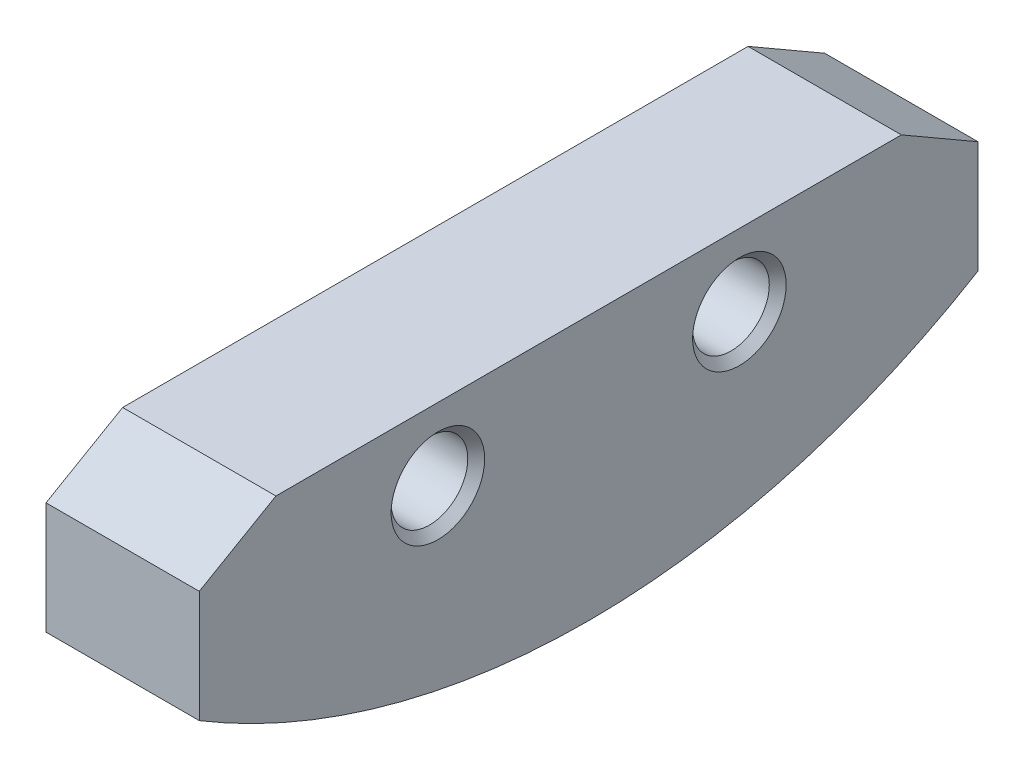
ISO-10303-21;
HEADER;
FILE_DESCRIPTION(('STEP AP214'),'2;1');
FILE_NAME('part.step','',(''),(''),'','','');
FILE_SCHEMA(('AUTOMOTIVE_DESIGN { 1 0 10303 214 1 1 1 1 }'));
ENDSEC;
DATA;
#1=APPLICATION_CONTEXT('core data for automotive mechanical design processes');
#2=APPLICATION_PROTOCOL_DEFINITION('international standard','automotive_design',2000,#1);
#3=PRODUCT_CONTEXT('',#1,'mechanical');
#4=PRODUCT('Part','Part','',(#3));
#5=PRODUCT_RELATED_PRODUCT_CATEGORY('part','',(#4));
#6=PRODUCT_DEFINITION_FORMATION('','',#4);
#7=PRODUCT_DEFINITION_CONTEXT('part definition',#1,'design');
#8=PRODUCT_DEFINITION('design','',#6,#7);
#9=PRODUCT_DEFINITION_SHAPE('','',#8);
#10=(LENGTH_UNIT() NAMED_UNIT(*) SI_UNIT(.MILLI.,.METRE.));
#11=(NAMED_UNIT(*) PLANE_ANGLE_UNIT() SI_UNIT($,.RADIAN.));
#12=(NAMED_UNIT(*) SI_UNIT($,.STERADIAN.) SOLID_ANGLE_UNIT());
#13=UNCERTAINTY_MEASURE_WITH_UNIT(LENGTH_MEASURE(1.E-05),#10,'distance_accuracy_value','');
#14=(GEOMETRIC_REPRESENTATION_CONTEXT(3) GLOBAL_UNCERTAINTY_ASSIGNED_CONTEXT((#13)) GLOBAL_UNIT_ASSIGNED_CONTEXT((#10,
#11,#12)) REPRESENTATION_CONTEXT('',''));
#15=CARTESIAN_POINT('',(0.,0.,0.));
#16=DIRECTION('',(0.,0.,1.));
#17=DIRECTION('',(1.,0.,0.));
#18=AXIS2_PLACEMENT_3D('',#15,#16,#17);
#19=CARTESIAN_POINT('',(2.5,0.,0.));
#20=DIRECTION('',(1.,0.,0.));
#21=DIRECTION('',(0.,0.,-1.));
#22=AXIS2_PLACEMENT_3D('',#19,#20,#21);
#23=PLANE('',#22);
#24=CARTESIAN_POINT('',(2.5,-18.3526072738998,-4.9175));
#25=DIRECTION('',(1.,0.,0.));
#26=DIRECTION('',(0.,0.,-1.));
#27=AXIS2_PLACEMENT_3D('',#24,#25,#26);
#28=CIRCLE('',#27,1.525);
#29=CARTESIAN_POINT('',(2.5,-18.3526072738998,-6.4425));
#30=VERTEX_POINT('',#29);
#31=EDGE_CURVE('E153',#30,#30,#28,.T.);
#32=ORIENTED_EDGE('',*,*,#31,.F.);
#33=EDGE_LOOP('',(#32));
#34=FACE_BOUND('',#33,.T.);
#35=CARTESIAN_POINT('',(2.5,-18.3526072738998,4.9175));
#36=DIRECTION('',(1.,0.,0.));
#37=DIRECTION('',(0.,0.,-1.));
#38=AXIS2_PLACEMENT_3D('',#35,#36,#37);
#39=CIRCLE('',#38,1.525);
#40=CARTESIAN_POINT('',(2.5,-18.3526072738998,3.3925));
#41=VERTEX_POINT('',#40);
#42=EDGE_CURVE('E144',#41,#41,#39,.T.);
#43=ORIENTED_EDGE('',*,*,#42,.F.);
#44=EDGE_LOOP('',(#43));
#45=FACE_BOUND('',#44,.T.);
#46=DIRECTION('',(0.,1.,0.));
#47=VECTOR('',#46,1.);
#48=CARTESIAN_POINT('',(2.5,-12.8916829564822,-12.7));
#49=LINE('',#48,#47);
#50=CARTESIAN_POINT('',(2.5,-21.0974080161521,-12.7));
#51=VERTEX_POINT('',#50);
#52=CARTESIAN_POINT('',(2.5,-17.4433756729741,-12.7));
#53=VERTEX_POINT('',#52);
#54=EDGE_CURVE('E90',#51,#53,#49,.T.);
#55=ORIENTED_EDGE('',*,*,#54,.T.);
#56=DIRECTION('',(0.,0.499999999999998,0.86602540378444));
#57=VECTOR('',#56,1.);
#58=CARTESIAN_POINT('',(2.5,-7.58327044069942,4.37820323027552));
#59=LINE('',#58,#57);
#60=CARTESIAN_POINT('',(2.5,-16.,-10.2));
#61=VERTEX_POINT('',#60);
#62=EDGE_CURVE('E44',#53,#61,#59,.T.);
#63=ORIENTED_EDGE('',*,*,#62,.T.);
#64=DIRECTION('',(0.,0.,-1.));
#65=VECTOR('',#64,1.);
#66=CARTESIAN_POINT('',(2.5,-16.,18.7187239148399));
#67=LINE('',#66,#65);
#68=CARTESIAN_POINT('',(2.5,-16.,10.2));
#69=VERTEX_POINT('',#68);
#70=EDGE_CURVE('E125',#69,#61,#67,.T.);
#71=ORIENTED_EDGE('',*,*,#70,.F.);
#72=DIRECTION('',(0.,0.499999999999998,-0.86602540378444));
#73=VECTOR('',#72,1.);
#74=CARTESIAN_POINT('',(2.5,-7.58327044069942,-4.37820323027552));
#75=LINE('',#74,#73);
#76=CARTESIAN_POINT('',(2.5,-17.4433756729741,12.7));
#77=VERTEX_POINT('',#76);
#78=EDGE_CURVE('E51',#69,#77,#75,.F.);
#79=ORIENTED_EDGE('',*,*,#78,.T.);
#80=DIRECTION('',(0.,1.,0.));
#81=VECTOR('',#80,1.);
#82=CARTESIAN_POINT('',(2.5,-12.8916829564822,12.7));
#83=LINE('',#82,#81);
#84=CARTESIAN_POINT('',(2.5,-21.0974080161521,12.7));
#85=VERTEX_POINT('',#84);
#86=EDGE_CURVE('E107',#85,#77,#83,.T.);
#87=ORIENTED_EDGE('',*,*,#86,.F.);
#88=CARTESIAN_POINT('',(2.5,0.,0.));
#89=DIRECTION('',(1.,0.,0.));
#90=DIRECTION('',(0.,0.,-1.));
#91=AXIS2_PLACEMENT_3D('',#88,#89,#90);
#92=CIRCLE('',#91,24.625);
#93=EDGE_CURVE('E103',#85,#51,#92,.T.);
#94=ORIENTED_EDGE('',*,*,#93,.T.);
#95=EDGE_LOOP('',(#55,#63,#71,#79,#87,#94));
#96=FACE_BOUND('',#95,.T.);
#97=ADVANCED_FACE('F36',(#34,#45,#96),#23,.T.);
#98=CARTESIAN_POINT('',(-2.5,0.,0.));
#99=DIRECTION('',(1.,0.,0.));
#100=DIRECTION('',(0.,0.,-1.));
#101=AXIS2_PLACEMENT_3D('',#98,#99,#100);
#102=PLANE('',#101);
#103=DIRECTION('',(0.,0.,1.));
#104=VECTOR('',#103,1.);
#105=CARTESIAN_POINT('',(-2.5,-16.,18.7187239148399));
#106=LINE('',#105,#104);
#107=CARTESIAN_POINT('',(-2.5,-16.,-10.2));
#108=VERTEX_POINT('',#107);
#109=CARTESIAN_POINT('',(-2.5,-16.,10.2));
#110=VERTEX_POINT('',#109);
#111=EDGE_CURVE('E112',#108,#110,#106,.T.);
#112=ORIENTED_EDGE('',*,*,#111,.F.);
#113=DIRECTION('',(0.,-0.499999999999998,-0.86602540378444));
#114=VECTOR('',#113,1.);
#115=CARTESIAN_POINT('',(-2.5,-16.,-10.2));
#116=LINE('',#115,#114);
#117=CARTESIAN_POINT('',(-2.5,-17.4433756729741,-12.7));
#118=VERTEX_POINT('',#117);
#119=EDGE_CURVE('E121',#108,#118,#116,.T.);
#120=ORIENTED_EDGE('',*,*,#119,.T.);
#121=DIRECTION('',(0.,-1.,0.));
#122=VECTOR('',#121,1.);
#123=CARTESIAN_POINT('',(-2.5,-12.8916829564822,-12.7));
#124=LINE('',#123,#122);
#125=CARTESIAN_POINT('',(-2.5,-21.0974080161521,-12.7));
#126=VERTEX_POINT('',#125);
#127=EDGE_CURVE('E97',#118,#126,#124,.T.);
#128=ORIENTED_EDGE('',*,*,#127,.T.);
#129=CARTESIAN_POINT('',(-2.5,0.,0.));
#130=DIRECTION('',(1.,0.,0.));
#131=DIRECTION('',(0.,0.,-1.));
#132=AXIS2_PLACEMENT_3D('',#129,#130,#131);
#133=CIRCLE('',#132,24.625);
#134=CARTESIAN_POINT('',(-2.5,-21.0974080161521,12.7));
#135=VERTEX_POINT('',#134);
#136=EDGE_CURVE('E105',#135,#126,#133,.T.);
#137=ORIENTED_EDGE('',*,*,#136,.F.);
#138=DIRECTION('',(0.,-1.,0.));
#139=VECTOR('',#138,1.);
#140=CARTESIAN_POINT('',(-2.5,-12.8916829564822,12.7));
#141=LINE('',#140,#139);
#142=CARTESIAN_POINT('',(-2.5,-17.4433756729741,12.7));
#143=VERTEX_POINT('',#142);
#144=EDGE_CURVE('E142',#143,#135,#141,.T.);
#145=ORIENTED_EDGE('',*,*,#144,.F.);
#146=DIRECTION('',(0.,-0.499999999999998,0.86602540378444));
#147=VECTOR('',#146,1.);
#148=CARTESIAN_POINT('',(-2.5,-17.4433756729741,12.7));
#149=LINE('',#148,#147);
#150=EDGE_CURVE('E119',#143,#110,#149,.F.);
#151=ORIENTED_EDGE('',*,*,#150,.T.);
#152=EDGE_LOOP('',(#112,#120,#128,#137,#145,#151));
#153=FACE_BOUND('',#152,.T.);
#154=ADVANCED_FACE('F136',(#153),#102,.F.);
#155=CARTESIAN_POINT('',(2.5,0.,0.));
#156=DIRECTION('',(-1.,0.,0.));
#157=DIRECTION('',(0.,0.,1.));
#158=AXIS2_PLACEMENT_3D('',#155,#156,#157);
#159=CYLINDRICAL_SURFACE('',#158,24.625);
#160=DIRECTION('',(-1.,0.,0.));
#161=VECTOR('',#160,1.);
#162=CARTESIAN_POINT('',(2.5,-21.0974080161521,-12.7));
#163=LINE('',#162,#161);
#164=EDGE_CURVE('E93',#126,#51,#163,.F.);
#165=ORIENTED_EDGE('',*,*,#164,.T.);
#166=ORIENTED_EDGE('',*,*,#93,.F.);
#167=DIRECTION('',(-1.,0.,0.));
#168=VECTOR('',#167,1.);
#169=CARTESIAN_POINT('',(2.5,-21.0974080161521,12.7));
#170=LINE('',#169,#168);
#171=EDGE_CURVE('E137',#135,#85,#170,.F.);
#172=ORIENTED_EDGE('',*,*,#171,.F.);
#173=ORIENTED_EDGE('',*,*,#136,.T.);
#174=EDGE_LOOP('',(#165,#166,#172,#173));
#175=FACE_BOUND('',#174,.T.);
#176=ADVANCED_FACE('F101',(#175),#159,.T.);
#177=CARTESIAN_POINT('',(-2.501,-16.,18.7187239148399));
#178=DIRECTION('',(0.,-1.,0.));
#179=DIRECTION('',(0.,0.,-1.));
#180=AXIS2_PLACEMENT_3D('',#177,#178,#179);
#181=PLANE('',#180);
#182=ORIENTED_EDGE('',*,*,#70,.T.);
#183=DIRECTION('',(-1.,0.,0.));
#184=VECTOR('',#183,1.);
#185=CARTESIAN_POINT('',(-2.5,-16.,-10.2));
#186=LINE('',#185,#184);
#187=EDGE_CURVE('E110',#61,#108,#186,.T.);
#188=ORIENTED_EDGE('',*,*,#187,.T.);
#189=ORIENTED_EDGE('',*,*,#111,.T.);
#190=DIRECTION('',(1.,0.,0.));
#191=VECTOR('',#190,1.);
#192=CARTESIAN_POINT('',(-2.501,-16.,10.2));
#193=LINE('',#192,#191);
#194=EDGE_CURVE('E108',#110,#69,#193,.T.);
#195=ORIENTED_EDGE('',*,*,#194,.T.);
#196=EDGE_LOOP('',(#182,#188,#189,#195));
#197=FACE_BOUND('',#196,.T.);
#198=ADVANCED_FACE('F129',(#197),#181,.F.);
#199=CARTESIAN_POINT('',(-1.,-18.3526072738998,-4.9175));
#200=DIRECTION('',(-1.,0.,0.));
#201=DIRECTION('',(0.,0.,1.));
#202=AXIS2_PLACEMENT_3D('',#199,#200,#201);
#203=PLANE('',#202);
#204=CARTESIAN_POINT('',(-1.,-18.3526072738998,-4.9175));
#205=DIRECTION('',(1.,0.,0.));
#206=DIRECTION('',(0.,0.,-1.));
#207=AXIS2_PLACEMENT_3D('',#204,#205,#206);
#208=CIRCLE('',#207,1.25);
#209=CARTESIAN_POINT('',(-1.,-18.3526072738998,-6.1675));
#210=VERTEX_POINT('',#209);
#211=EDGE_CURVE('E133',#210,#210,#208,.T.);
#212=ORIENTED_EDGE('',*,*,#211,.T.);
#213=EDGE_LOOP('',(#212));
#214=FACE_BOUND('',#213,.T.);
#215=ADVANCED_FACE('F162',(#214),#203,.F.);
#216=CARTESIAN_POINT('',(2.5,-18.3526072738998,-4.9175));
#217=DIRECTION('',(1.,0.,0.));
#218=DIRECTION('',(0.,0.,-1.));
#219=AXIS2_PLACEMENT_3D('',#216,#217,#218);
#220=CYLINDRICAL_SURFACE('',#219,1.25);
#221=ORIENTED_EDGE('',*,*,#211,.F.);
#222=EDGE_LOOP('',(#221));
#223=FACE_BOUND('',#222,.T.);
#224=CARTESIAN_POINT('',(2.225,-18.3526072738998,-4.9175));
#225=DIRECTION('',(1.,0.,0.));
#226=DIRECTION('',(0.,0.,-1.));
#227=AXIS2_PLACEMENT_3D('',#224,#225,#226);
#228=CIRCLE('',#227,1.25);
#229=CARTESIAN_POINT('',(2.225,-18.3526072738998,-6.1675));
#230=VERTEX_POINT('',#229);
#231=EDGE_CURVE('E156',#230,#230,#228,.T.);
#232=ORIENTED_EDGE('',*,*,#231,.T.);
#233=EDGE_LOOP('',(#232));
#234=FACE_BOUND('',#233,.T.);
#235=ADVANCED_FACE('F164',(#223,#234),#220,.F.);
#236=CARTESIAN_POINT('',(2.5,-18.3526072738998,-4.9175));
#237=DIRECTION('',(1.,0.,0.));
#238=DIRECTION('',(0.,0.,-1.));
#239=AXIS2_PLACEMENT_3D('',#236,#237,#238);
#240=CONICAL_SURFACE('',#239,1.525,0.785398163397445);
#241=ORIENTED_EDGE('',*,*,#231,.F.);
#242=EDGE_LOOP('',(#241));
#243=FACE_BOUND('',#242,.T.);
#244=ORIENTED_EDGE('',*,*,#31,.T.);
#245=EDGE_LOOP('',(#244));
#246=FACE_BOUND('',#245,.T.);
#247=ADVANCED_FACE('F167',(#243,#246),#240,.F.);
#248=CARTESIAN_POINT('',(-1.,-18.3526072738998,4.9175));
#249=DIRECTION('',(-1.,0.,0.));
#250=DIRECTION('',(0.,0.,1.));
#251=AXIS2_PLACEMENT_3D('',#248,#249,#250);
#252=PLANE('',#251);
#253=CARTESIAN_POINT('',(-1.,-18.3526072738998,4.9175));
#254=DIRECTION('',(1.,0.,0.));
#255=DIRECTION('',(0.,0.,-1.));
#256=AXIS2_PLACEMENT_3D('',#253,#254,#255);
#257=CIRCLE('',#256,1.25);
#258=CARTESIAN_POINT('',(-1.,-18.3526072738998,3.6675));
#259=VERTEX_POINT('',#258);
#260=EDGE_CURVE('E150',#259,#259,#257,.T.);
#261=ORIENTED_EDGE('',*,*,#260,.T.);
#262=EDGE_LOOP('',(#261));
#263=FACE_BOUND('',#262,.T.);
#264=ADVANCED_FACE('F173',(#263),#252,.F.);
#265=CARTESIAN_POINT('',(2.5,-18.3526072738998,4.9175));
#266=DIRECTION('',(1.,0.,0.));
#267=DIRECTION('',(0.,0.,-1.));
#268=AXIS2_PLACEMENT_3D('',#265,#266,#267);
#269=CYLINDRICAL_SURFACE('',#268,1.25);
#270=ORIENTED_EDGE('',*,*,#260,.F.);
#271=EDGE_LOOP('',(#270));
#272=FACE_BOUND('',#271,.T.);
#273=CARTESIAN_POINT('',(2.225,-18.3526072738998,4.9175));
#274=DIRECTION('',(1.,0.,0.));
#275=DIRECTION('',(0.,0.,-1.));
#276=AXIS2_PLACEMENT_3D('',#273,#274,#275);
#277=CIRCLE('',#276,1.25);
#278=CARTESIAN_POINT('',(2.225,-18.3526072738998,3.6675));
#279=VERTEX_POINT('',#278);
#280=EDGE_CURVE('E147',#279,#279,#277,.T.);
#281=ORIENTED_EDGE('',*,*,#280,.T.);
#282=EDGE_LOOP('',(#281));
#283=FACE_BOUND('',#282,.T.);
#284=ADVANCED_FACE('F185',(#272,#283),#269,.F.);
#285=CARTESIAN_POINT('',(2.5,-18.3526072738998,4.9175));
#286=DIRECTION('',(1.,0.,0.));
#287=DIRECTION('',(0.,0.,-1.));
#288=AXIS2_PLACEMENT_3D('',#285,#286,#287);
#289=CONICAL_SURFACE('',#288,1.525,0.785398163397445);
#290=ORIENTED_EDGE('',*,*,#280,.F.);
#291=EDGE_LOOP('',(#290));
#292=FACE_BOUND('',#291,.T.);
#293=ORIENTED_EDGE('',*,*,#42,.T.);
#294=EDGE_LOOP('',(#293));
#295=FACE_BOUND('',#294,.T.);
#296=ADVANCED_FACE('F182',(#292,#295),#289,.F.);
#297=CARTESIAN_POINT('',(-2.501,-12.8916829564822,12.7));
#298=DIRECTION('',(0.,0.,-1.));
#299=DIRECTION('',(0.,1.,0.));
#300=AXIS2_PLACEMENT_3D('',#297,#298,#299);
#301=PLANE('',#300);
#302=ORIENTED_EDGE('',*,*,#86,.T.);
#303=DIRECTION('',(-1.,0.,0.));
#304=VECTOR('',#303,1.);
#305=CARTESIAN_POINT('',(-2.501,-17.4433756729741,12.7));
#306=LINE('',#305,#304);
#307=EDGE_CURVE('E11',#77,#143,#306,.T.);
#308=ORIENTED_EDGE('',*,*,#307,.T.);
#309=ORIENTED_EDGE('',*,*,#144,.T.);
#310=ORIENTED_EDGE('',*,*,#171,.T.);
#311=EDGE_LOOP('',(#302,#308,#309,#310));
#312=FACE_BOUND('',#311,.T.);
#313=ADVANCED_FACE('F184',(#312),#301,.F.);
#314=CARTESIAN_POINT('',(-2.501,-12.8916829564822,-12.7));
#315=DIRECTION('',(0.,0.,-1.));
#316=DIRECTION('',(0.,1.,0.));
#317=AXIS2_PLACEMENT_3D('',#314,#315,#316);
#318=PLANE('',#317);
#319=ORIENTED_EDGE('',*,*,#127,.F.);
#320=DIRECTION('',(1.,0.,0.));
#321=VECTOR('',#320,1.);
#322=CARTESIAN_POINT('',(2.5,-17.4433756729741,-12.7));
#323=LINE('',#322,#321);
#324=EDGE_CURVE('E59',#118,#53,#323,.T.);
#325=ORIENTED_EDGE('',*,*,#324,.T.);
#326=ORIENTED_EDGE('',*,*,#54,.F.);
#327=ORIENTED_EDGE('',*,*,#164,.F.);
#328=EDGE_LOOP('',(#319,#325,#326,#327));
#329=FACE_BOUND('',#328,.T.);
#330=ADVANCED_FACE('F92',(#329),#318,.T.);
#331=CARTESIAN_POINT('',(-2.501,-16.,-10.2));
#332=DIRECTION('',(0.,0.86602540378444,-0.499999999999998));
#333=DIRECTION('',(0.,0.499999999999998,0.86602540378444));
#334=AXIS2_PLACEMENT_3D('',#331,#332,#333);
#335=PLANE('',#334);
#336=ORIENTED_EDGE('',*,*,#62,.F.);
#337=ORIENTED_EDGE('',*,*,#324,.F.);
#338=ORIENTED_EDGE('',*,*,#119,.F.);
#339=ORIENTED_EDGE('',*,*,#187,.F.);
#340=EDGE_LOOP('',(#336,#337,#338,#339));
#341=FACE_BOUND('',#340,.T.);
#342=ADVANCED_FACE('F134',(#341),#335,.T.);
#343=CARTESIAN_POINT('',(-2.501,-17.4433756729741,12.7));
#344=DIRECTION('',(0.,-0.86602540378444,-0.499999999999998));
#345=DIRECTION('',(0.,0.499999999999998,-0.86602540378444));
#346=AXIS2_PLACEMENT_3D('',#343,#344,#345);
#347=PLANE('',#346);
#348=ORIENTED_EDGE('',*,*,#78,.F.);
#349=ORIENTED_EDGE('',*,*,#194,.F.);
#350=ORIENTED_EDGE('',*,*,#150,.F.);
#351=ORIENTED_EDGE('',*,*,#307,.F.);
#352=EDGE_LOOP('',(#348,#349,#350,#351));
#353=FACE_BOUND('',#352,.T.);
#354=ADVANCED_FACE('F38',(#353),#347,.F.);
#355=CLOSED_SHELL('',(#97,#154,#176,#198,#215,#235,#247,#264,#284,#296,#313,#330,#342,#354));
#356=MANIFOLD_SOLID_BREP('B2',#355);
#357=ADVANCED_BREP_SHAPE_REPRESENTATION('',(#18,#356),#14);
#358=SHAPE_DEFINITION_REPRESENTATION(#9,#357);
ENDSEC;
END-ISO-10303-21;
